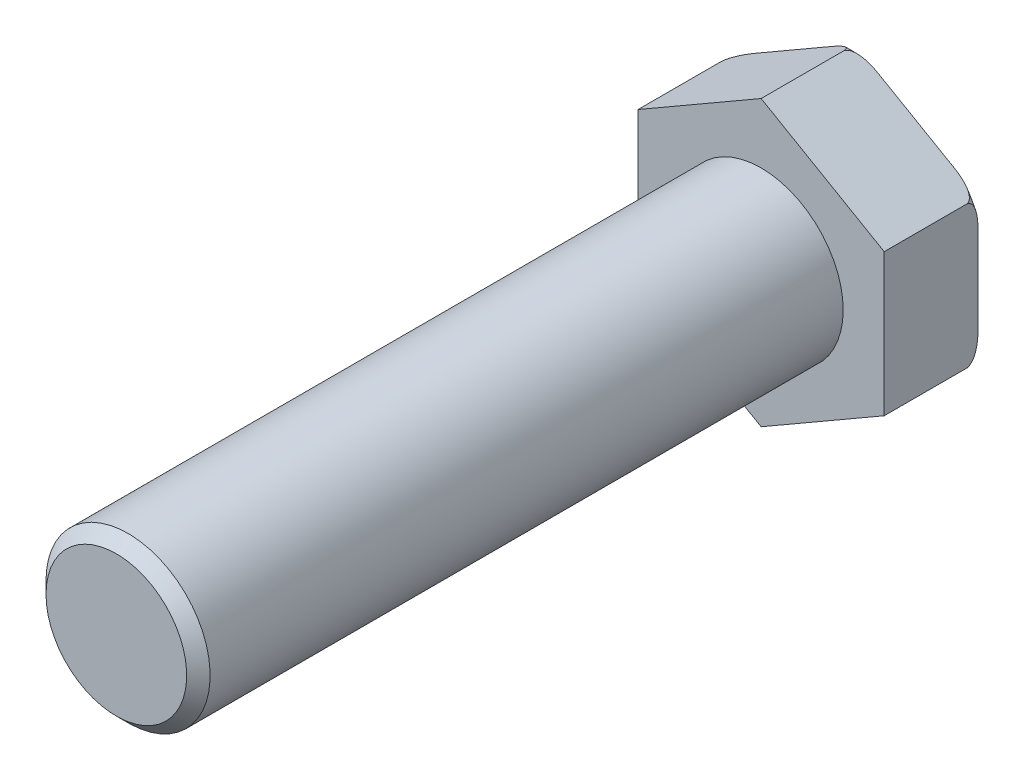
from build123d import *

# Parameters (mm, degrees)
TETE_DEPTH            = 8
PROFIL_CYLINDRE_R     = 7
CYLINDRE_FILETE_DEPTH = 55


with BuildPart() as part:
    # profil t_te → TETE (new body)
    with BuildSketch(Plane.XY):
        Polygon((-10.5, 6.062177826), (-10.5, -6.062177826), (0, -12.124355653), (10.5, -6.062177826), (10.5, 6.062177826), (0, 12.124355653), align=None)
    extrude(amount=TETE_DEPTH)

    # profil cong → CONGE (revolve, cut)
    with BuildSketch(Plane(origin=(0, 0, 0), x_dir=(0, 0, -1), z_dir=(1, 0, 0))):
        with BuildLine():
            Line((-1, 12.124355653), (0, 12.124355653))
            Line((0, 12.124355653), (0, 11.124355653))
            ThreePointArc((0, 11.124355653), (-0.292893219, 11.831462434), (-1, 12.124355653))
        make_face()
    revolve(axis=Axis((0, 0, 0), (0, 0, -1)), mode=Mode.SUBTRACT)

    # profil cylindre → CYLINDRE FILETE (add)
    with BuildSketch(Plane.XY.offset(8)):
        Circle(PROFIL_CYLINDRE_R)
    extrude(amount=CYLINDRE_FILETE_DEPTH)

    # profil chanfrein → CHANFREIN FILET (revolve, cut)
    with BuildSketch(Plane(origin=(0, 0, 0), x_dir=(0, 0, -1), z_dir=(1, 0, 0)), mode=Mode.PRIVATE) as chanfrein_filet_sk:
        Polygon((-63, 6), (-62, 7), (-63, 7), align=None)
    revolve(chanfrein_filet_sk.sketch.rotate(Axis((0, 0, 12.087417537), (0, 0, 1)), 90), axis=Axis((0, 0, 12.087417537), (0, 0, 1)), mode=Mode.SUBTRACT)


solid = part.part
